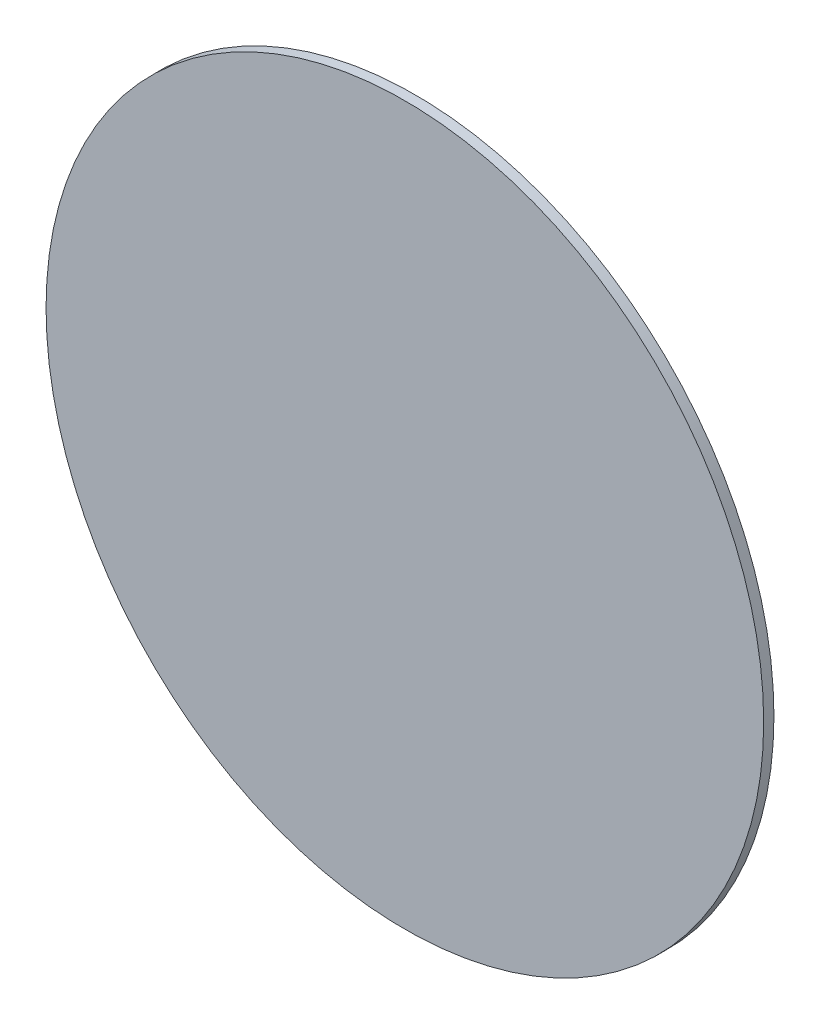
ISO-10303-21;
HEADER;
FILE_DESCRIPTION(('STEP AP214'),'2;1');
FILE_NAME('part.step','',(''),(''),'','','');
FILE_SCHEMA(('AUTOMOTIVE_DESIGN { 1 0 10303 214 1 1 1 1 }'));
ENDSEC;
DATA;
#1=APPLICATION_CONTEXT('core data for automotive mechanical design processes');
#2=APPLICATION_PROTOCOL_DEFINITION('international standard','automotive_design',2000,#1);
#3=PRODUCT_CONTEXT('',#1,'mechanical');
#4=PRODUCT('Part','Part','',(#3));
#5=PRODUCT_RELATED_PRODUCT_CATEGORY('part','',(#4));
#6=PRODUCT_DEFINITION_FORMATION('','',#4);
#7=PRODUCT_DEFINITION_CONTEXT('part definition',#1,'design');
#8=PRODUCT_DEFINITION('design','',#6,#7);
#9=PRODUCT_DEFINITION_SHAPE('','',#8);
#10=(LENGTH_UNIT() NAMED_UNIT(*) SI_UNIT(.MILLI.,.METRE.));
#11=(NAMED_UNIT(*) PLANE_ANGLE_UNIT() SI_UNIT($,.RADIAN.));
#12=(NAMED_UNIT(*) SI_UNIT($,.STERADIAN.) SOLID_ANGLE_UNIT());
#13=UNCERTAINTY_MEASURE_WITH_UNIT(LENGTH_MEASURE(1.E-05),#10,'distance_accuracy_value','');
#14=(GEOMETRIC_REPRESENTATION_CONTEXT(3) GLOBAL_UNCERTAINTY_ASSIGNED_CONTEXT((#13)) GLOBAL_UNIT_ASSIGNED_CONTEXT((#10,
#11,#12)) REPRESENTATION_CONTEXT('',''));
#15=CARTESIAN_POINT('',(0.,0.,0.));
#16=DIRECTION('',(0.,0.,1.));
#17=DIRECTION('',(1.,0.,0.));
#18=AXIS2_PLACEMENT_3D('',#15,#16,#17);
#19=CARTESIAN_POINT('',(0.,0.,0.5));
#20=DIRECTION('',(0.,0.,-1.));
#21=DIRECTION('',(-1.,0.,0.));
#22=AXIS2_PLACEMENT_3D('',#19,#20,#21);
#23=CYLINDRICAL_SURFACE('',#22,17.5);
#24=CARTESIAN_POINT('',(0.,0.,0.5));
#25=DIRECTION('',(0.,0.,1.));
#26=DIRECTION('',(1.,0.,0.));
#27=AXIS2_PLACEMENT_3D('',#24,#25,#26);
#28=CIRCLE('',#27,17.5);
#29=CARTESIAN_POINT('',(17.5,0.,0.5));
#30=VERTEX_POINT('',#29);
#31=EDGE_CURVE('E10',#30,#30,#28,.T.);
#32=ORIENTED_EDGE('',*,*,#31,.F.);
#33=EDGE_LOOP('',(#32));
#34=FACE_BOUND('',#33,.T.);
#35=CARTESIAN_POINT('',(0.,0.,0.));
#36=DIRECTION('',(0.,0.,1.));
#37=DIRECTION('',(1.,0.,0.));
#38=AXIS2_PLACEMENT_3D('',#35,#36,#37);
#39=CIRCLE('',#38,17.5);
#40=CARTESIAN_POINT('',(17.5,0.,0.));
#41=VERTEX_POINT('',#40);
#42=EDGE_CURVE('E44',#41,#41,#39,.T.);
#43=ORIENTED_EDGE('',*,*,#42,.T.);
#44=EDGE_LOOP('',(#43));
#45=FACE_BOUND('',#44,.T.);
#46=ADVANCED_FACE('F41',(#34,#45),#23,.T.);
#47=CARTESIAN_POINT('',(0.,0.,0.5));
#48=DIRECTION('',(0.,0.,1.));
#49=DIRECTION('',(1.,0.,0.));
#50=AXIS2_PLACEMENT_3D('',#47,#48,#49);
#51=PLANE('',#50);
#52=ORIENTED_EDGE('',*,*,#31,.T.);
#53=EDGE_LOOP('',(#52));
#54=FACE_BOUND('',#53,.T.);
#55=ADVANCED_FACE('F56',(#54),#51,.T.);
#56=CARTESIAN_POINT('',(0.,0.,0.));
#57=DIRECTION('',(0.,0.,1.));
#58=DIRECTION('',(1.,0.,0.));
#59=AXIS2_PLACEMENT_3D('',#56,#57,#58);
#60=PLANE('',#59);
#61=ORIENTED_EDGE('',*,*,#42,.F.);
#62=EDGE_LOOP('',(#61));
#63=FACE_BOUND('',#62,.T.);
#64=ADVANCED_FACE('F54',(#63),#60,.F.);
#65=CLOSED_SHELL('',(#46,#55,#64));
#66=MANIFOLD_SOLID_BREP('B2',#65);
#67=ADVANCED_BREP_SHAPE_REPRESENTATION('',(#18,#66),#14);
#68=SHAPE_DEFINITION_REPRESENTATION(#9,#67);
ENDSEC;
END-ISO-10303-21;
